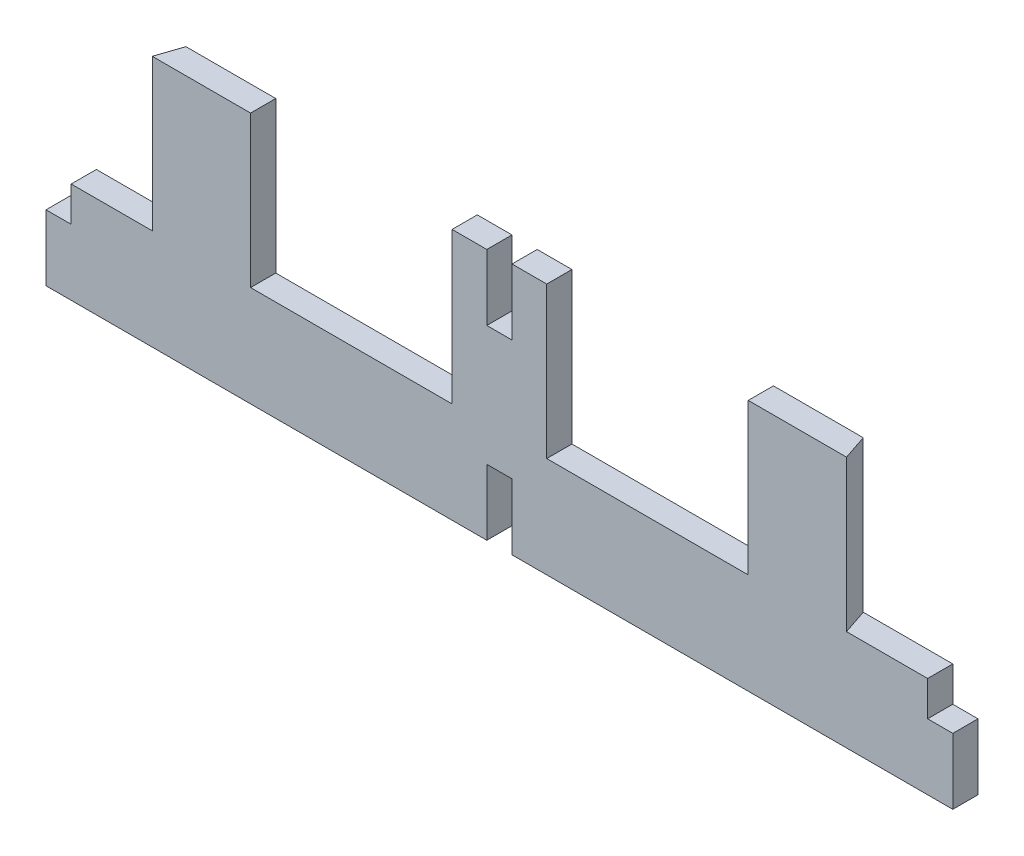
from build123d import *

# Parameters (mm, degrees)
EXTRUDE1_DEPTH     = 12.7
SKETCH4_W          = 101.6
SKETCH4_H          = 12.7
CUT_EXTRUDE3_DEPTH = 76.2


with BuildPart() as part:
    # Sketch1 → Extrude1 (new body)
    with BuildSketch(Plane.XY):
        Polygon((-228.6, 127), (-6.35, 127), (-6.35, 93.809455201), (6.35, 93.809455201), (6.35, 127), (228.6, 127), (228.6, 93.809455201), (215.9, 93.809455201), (215.9, 33.190544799), (228.6, 33.190544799), (228.6, 0), (6.35, 0), (6.35, 33.190544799), (-6.35, 33.190544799), (-6.35, 0), (-228.6, 0), (-228.6, 33.190544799), (-215.9, 33.190544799), (-215.9, 93.809455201), (-228.6, 93.809455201), align=None)
    extrude(amount=EXTRUDE1_DEPTH)

    # Sketch4 → Cut-Extrude3 (cut)
    with BuildSketch(Plane(origin=(0, 127, 0), x_dir=(1, 0, 0), z_dir=(0, 1, 0))):
        with Locations((74.659231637, -6.35)):
            Rectangle(SKETCH4_W, SKETCH4_H)
        with Locations((-74.659231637, -6.35)):
            Rectangle(SKETCH4_W, SKETCH4_H)
        Polygon((-228.6, 0), (-228.6, -12.7), (-175.009831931, -12.7), (-170.743201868, 0), align=None)
        Polygon((175.009831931, -12.7), (228.6, -12.7), (228.6, 0), (170.743201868, 0), align=None)
    extrude(amount=-CUT_EXTRUDE3_DEPTH, mode=Mode.SUBTRACT)


solid = part.part
